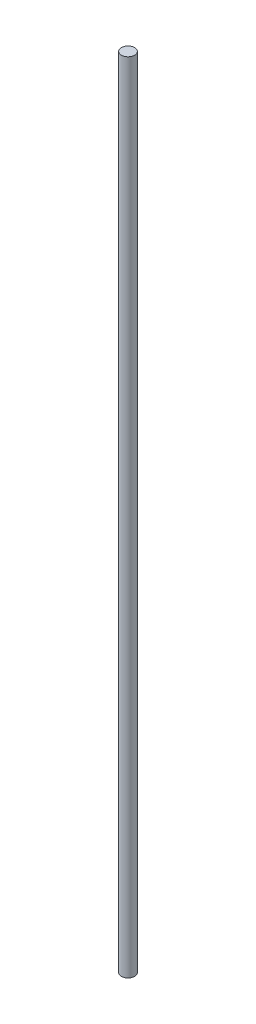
ISO-10303-21;
HEADER;
FILE_DESCRIPTION(('STEP AP214'),'2;1');
FILE_NAME('part.step','',(''),(''),'','','');
FILE_SCHEMA(('AUTOMOTIVE_DESIGN { 1 0 10303 214 1 1 1 1 }'));
ENDSEC;
DATA;
#1=APPLICATION_CONTEXT('core data for automotive mechanical design processes');
#2=APPLICATION_PROTOCOL_DEFINITION('international standard','automotive_design',2000,#1);
#3=PRODUCT_CONTEXT('',#1,'mechanical');
#4=PRODUCT('Part','Part','',(#3));
#5=PRODUCT_RELATED_PRODUCT_CATEGORY('part','',(#4));
#6=PRODUCT_DEFINITION_FORMATION('','',#4);
#7=PRODUCT_DEFINITION_CONTEXT('part definition',#1,'design');
#8=PRODUCT_DEFINITION('design','',#6,#7);
#9=PRODUCT_DEFINITION_SHAPE('','',#8);
#10=(LENGTH_UNIT() NAMED_UNIT(*) SI_UNIT(.MILLI.,.METRE.));
#11=(NAMED_UNIT(*) PLANE_ANGLE_UNIT() SI_UNIT($,.RADIAN.));
#12=(NAMED_UNIT(*) SI_UNIT($,.STERADIAN.) SOLID_ANGLE_UNIT());
#13=UNCERTAINTY_MEASURE_WITH_UNIT(LENGTH_MEASURE(1.E-05),#10,'distance_accuracy_value','');
#14=(GEOMETRIC_REPRESENTATION_CONTEXT(3) GLOBAL_UNCERTAINTY_ASSIGNED_CONTEXT((#13)) GLOBAL_UNIT_ASSIGNED_CONTEXT((#10,
#11,#12)) REPRESENTATION_CONTEXT('',''));
#15=CARTESIAN_POINT('',(0.,0.,0.));
#16=DIRECTION('',(0.,0.,1.));
#17=DIRECTION('',(1.,0.,0.));
#18=AXIS2_PLACEMENT_3D('',#15,#16,#17);
#19=CARTESIAN_POINT('',(0.,482.6,0.));
#20=DIRECTION('',(0.,-1.,0.));
#21=DIRECTION('',(0.,0.,-1.));
#22=AXIS2_PLACEMENT_3D('',#19,#20,#21);
#23=CYLINDRICAL_SURFACE('',#22,4.);
#24=CARTESIAN_POINT('',(0.,482.6,0.));
#25=DIRECTION('',(0.,1.,0.));
#26=DIRECTION('',(0.,0.,1.));
#27=AXIS2_PLACEMENT_3D('',#24,#25,#26);
#28=CIRCLE('',#27,4.);
#29=CARTESIAN_POINT('',(0.,482.6,-4.));
#30=VERTEX_POINT('',#29);
#31=EDGE_CURVE('E10',#30,#30,#28,.T.);
#32=CARTESIAN_POINT('',(0.,0.,0.));
#33=DIRECTION('',(0.,1.,0.));
#34=DIRECTION('',(0.,0.,1.));
#35=AXIS2_PLACEMENT_3D('',#32,#33,#34);
#36=CIRCLE('',#35,4.);
#37=CARTESIAN_POINT('',(0.,0.,-4.));
#38=VERTEX_POINT('',#37);
#39=EDGE_CURVE('E33',#38,#38,#36,.T.);
#40=CARTESIAN_POINT('',(0.,482.6,-4.));
#41=CARTESIAN_POINT('',(0.,477.572916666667,-4.));
#42=CARTESIAN_POINT('',(0.,472.545833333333,-4.));
#43=CARTESIAN_POINT('',(0.,462.491666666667,-4.));
#44=CARTESIAN_POINT('',(0.,457.464583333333,-4.));
#45=CARTESIAN_POINT('',(0.,447.410416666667,-4.));
#46=CARTESIAN_POINT('',(0.,442.383333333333,-4.));
#47=CARTESIAN_POINT('',(0.,432.329166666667,-4.));
#48=CARTESIAN_POINT('',(0.,427.302083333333,-4.));
#49=CARTESIAN_POINT('',(0.,417.247916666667,-4.));
#50=CARTESIAN_POINT('',(0.,412.220833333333,-4.));
#51=CARTESIAN_POINT('',(0.,402.166666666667,-4.));
#52=CARTESIAN_POINT('',(0.,397.139583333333,-4.));
#53=CARTESIAN_POINT('',(0.,387.085416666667,-4.));
#54=CARTESIAN_POINT('',(0.,382.058333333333,-4.));
#55=CARTESIAN_POINT('',(0.,372.004166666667,-4.));
#56=CARTESIAN_POINT('',(0.,366.977083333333,-4.));
#57=CARTESIAN_POINT('',(0.,356.922916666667,-4.));
#58=CARTESIAN_POINT('',(0.,351.895833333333,-4.));
#59=CARTESIAN_POINT('',(0.,341.841666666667,-4.));
#60=CARTESIAN_POINT('',(0.,336.814583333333,-4.));
#61=CARTESIAN_POINT('',(0.,326.760416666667,-4.));
#62=CARTESIAN_POINT('',(0.,321.733333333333,-4.));
#63=CARTESIAN_POINT('',(0.,311.679166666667,-4.));
#64=CARTESIAN_POINT('',(0.,306.652083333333,-4.));
#65=CARTESIAN_POINT('',(0.,296.597916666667,-4.));
#66=CARTESIAN_POINT('',(0.,291.570833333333,-4.));
#67=CARTESIAN_POINT('',(0.,281.516666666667,-4.));
#68=CARTESIAN_POINT('',(0.,276.489583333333,-4.));
#69=CARTESIAN_POINT('',(0.,266.435416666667,-4.));
#70=CARTESIAN_POINT('',(0.,261.408333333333,-4.));
#71=CARTESIAN_POINT('',(0.,251.354166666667,-4.));
#72=CARTESIAN_POINT('',(0.,246.327083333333,-4.));
#73=CARTESIAN_POINT('',(0.,236.272916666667,-4.));
#74=CARTESIAN_POINT('',(0.,231.245833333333,-4.));
#75=CARTESIAN_POINT('',(0.,221.191666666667,-4.));
#76=CARTESIAN_POINT('',(0.,216.164583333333,-4.));
#77=CARTESIAN_POINT('',(0.,206.110416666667,-4.));
#78=CARTESIAN_POINT('',(0.,201.083333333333,-4.));
#79=CARTESIAN_POINT('',(0.,191.029166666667,-4.));
#80=CARTESIAN_POINT('',(0.,186.002083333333,-4.));
#81=CARTESIAN_POINT('',(0.,175.947916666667,-4.));
#82=CARTESIAN_POINT('',(0.,170.920833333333,-4.));
#83=CARTESIAN_POINT('',(0.,160.866666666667,-4.));
#84=CARTESIAN_POINT('',(0.,155.839583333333,-4.));
#85=CARTESIAN_POINT('',(0.,145.785416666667,-4.));
#86=CARTESIAN_POINT('',(0.,140.758333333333,-4.));
#87=CARTESIAN_POINT('',(0.,130.704166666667,-4.));
#88=CARTESIAN_POINT('',(0.,125.677083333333,-4.));
#89=CARTESIAN_POINT('',(0.,115.622916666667,-4.));
#90=CARTESIAN_POINT('',(0.,110.595833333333,-4.));
#91=CARTESIAN_POINT('',(0.,100.541666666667,-4.));
#92=CARTESIAN_POINT('',(0.,95.5145833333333,-4.));
#93=CARTESIAN_POINT('',(0.,85.4604166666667,-4.));
#94=CARTESIAN_POINT('',(0.,80.4333333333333,-4.));
#95=CARTESIAN_POINT('',(0.,70.3791666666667,-4.));
#96=CARTESIAN_POINT('',(0.,65.3520833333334,-4.));
#97=CARTESIAN_POINT('',(0.,55.2979166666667,-4.));
#98=CARTESIAN_POINT('',(0.,50.2708333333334,-4.));
#99=CARTESIAN_POINT('',(0.,40.2166666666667,-4.));
#100=CARTESIAN_POINT('',(0.,35.1895833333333,-4.));
#101=CARTESIAN_POINT('',(0.,25.1354166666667,-4.));
#102=CARTESIAN_POINT('',(0.,20.1083333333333,-4.));
#103=CARTESIAN_POINT('',(0.,10.0541666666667,-4.));
#104=CARTESIAN_POINT('',(0.,5.02708333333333,-4.));
#105=CARTESIAN_POINT('',(0.,0.,-4.));
#106=B_SPLINE_CURVE_WITH_KNOTS('',3,(#40,#41,#42,#43,#44,#45,#46,#47,#48,#49,#50,#51,#52,#53,
#54,#55,#56,#57,#58,#59,#60,#61,#62,#63,#64,#65,#66,#67,#68,#69,#70,#71,#72,#73,#74,#75,#76,#77,
#78,#79,#80,#81,#82,#83,#84,#85,#86,#87,#88,#89,#90,#91,#92,#93,#94,#95,#96,#97,#98,#99,#100,
#101,#102,#103,#104,#105),.UNSPECIFIED.,.F.,.F.,(4,2,2,2,2,2,2,2,2,2,2,2,2,2,2,2,2,2,2,2,2,2,2,
2,2,2,2,2,2,2,2,2,4),(0.,15.08125,30.1625,45.24375,60.325,75.40625,90.4875,105.56875,120.65,
135.73125,150.8125,165.89375,180.975,196.05625,211.1375,226.21875,241.3,256.38125,271.4625,
286.54375,301.625,316.70625,331.7875,346.86875,361.95,377.03125,392.1125,407.19375,422.275,
437.35625,452.4375,467.51875,482.6),.UNSPECIFIED.);
#107=EDGE_CURVE('BSEAM30',#30,#38,#106,.T.);
#108=ORIENTED_EDGE('',*,*,#31,.F.);
#109=ORIENTED_EDGE('',*,*,#39,.T.);
#110=ORIENTED_EDGE('',*,*,#107,.T.);
#111=ORIENTED_EDGE('',*,*,#107,.F.);
#112=EDGE_LOOP('',(#108,#110,#109,#111));
#113=FACE_BOUND('',#112,.T.);
#114=ADVANCED_FACE('F30',(#113),#23,.T.);
#115=CARTESIAN_POINT('',(0.,482.6,0.));
#116=DIRECTION('',(0.,1.,0.));
#117=DIRECTION('',(0.,0.,1.));
#118=AXIS2_PLACEMENT_3D('',#115,#116,#117);
#119=PLANE('',#118);
#120=ORIENTED_EDGE('',*,*,#31,.T.);
#121=EDGE_LOOP('',(#120));
#122=FACE_BOUND('',#121,.T.);
#123=ADVANCED_FACE('F45',(#122),#119,.T.);
#124=CARTESIAN_POINT('',(0.,0.,0.));
#125=DIRECTION('',(0.,1.,0.));
#126=DIRECTION('',(0.,0.,1.));
#127=AXIS2_PLACEMENT_3D('',#124,#125,#126);
#128=PLANE('',#127);
#129=ORIENTED_EDGE('',*,*,#39,.F.);
#130=EDGE_LOOP('',(#129));
#131=FACE_BOUND('',#130,.T.);
#132=ADVANCED_FACE('F43',(#131),#128,.F.);
#133=CLOSED_SHELL('',(#114,#123,#132));
#134=MANIFOLD_SOLID_BREP('B2',#133);
#135=ADVANCED_BREP_SHAPE_REPRESENTATION('',(#18,#134),#14);
#136=SHAPE_DEFINITION_REPRESENTATION(#9,#135);
ENDSEC;
END-ISO-10303-21;
